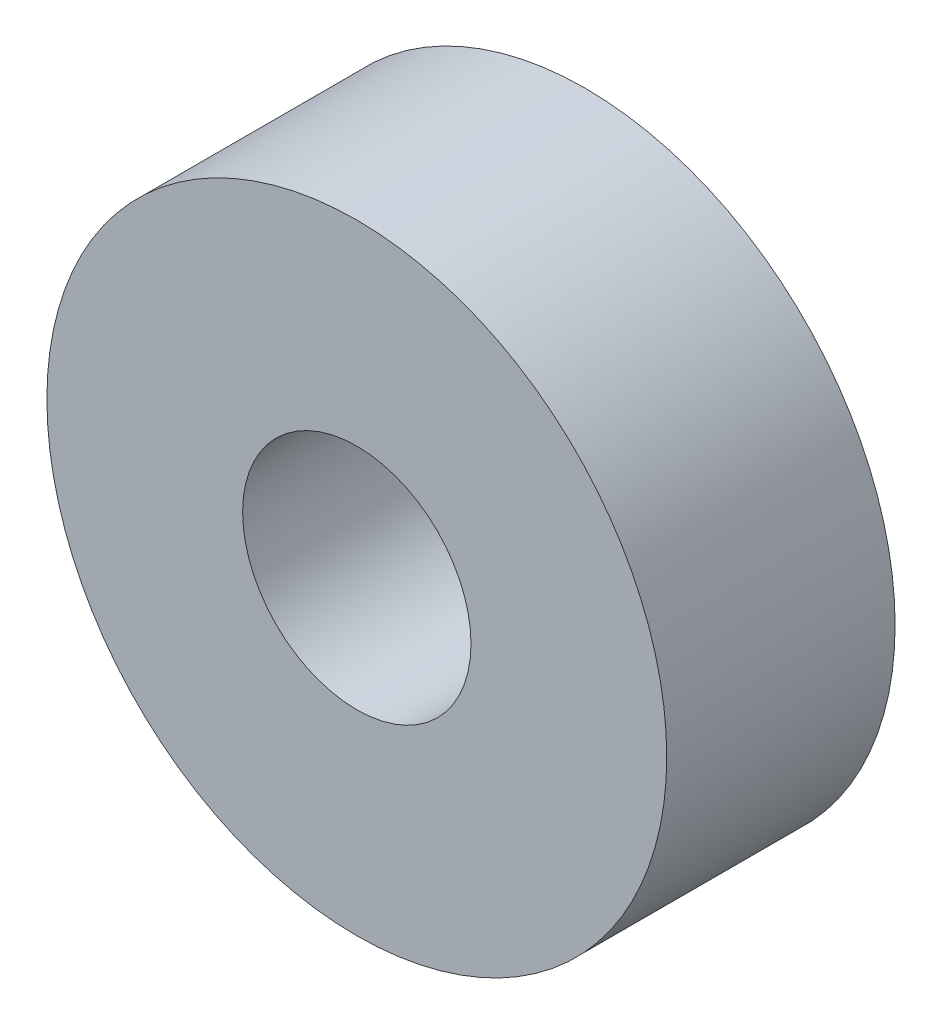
from build123d import *

# Parameters (mm, degrees)
SKETCH1_R      = 4.75
SKETCH1_R_2    = 1.75
EXTRUDE1_DEPTH = 3.5


with BuildPart() as part:
    # Sketch1 → Extrude1 (new body)
    with BuildSketch(Plane.XY):
        Circle(SKETCH1_R)
        Circle(SKETCH1_R_2, mode=Mode.SUBTRACT)
    extrude(amount=EXTRUDE1_DEPTH)


solid = part.part
